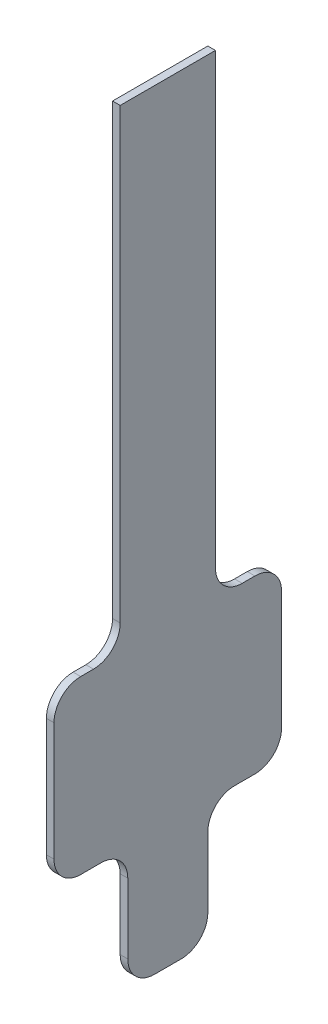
ISO-10303-21;
HEADER;
FILE_DESCRIPTION(('STEP AP214'),'2;1');
FILE_NAME('part.step','',(''),(''),'','','');
FILE_SCHEMA(('AUTOMOTIVE_DESIGN { 1 0 10303 214 1 1 1 1 }'));
ENDSEC;
DATA;
#1=APPLICATION_CONTEXT('core data for automotive mechanical design processes');
#2=APPLICATION_PROTOCOL_DEFINITION('international standard','automotive_design',2000,#1);
#3=PRODUCT_CONTEXT('',#1,'mechanical');
#4=PRODUCT('Part','Part','',(#3));
#5=PRODUCT_RELATED_PRODUCT_CATEGORY('part','',(#4));
#6=PRODUCT_DEFINITION_FORMATION('','',#4);
#7=PRODUCT_DEFINITION_CONTEXT('part definition',#1,'design');
#8=PRODUCT_DEFINITION('design','',#6,#7);
#9=PRODUCT_DEFINITION_SHAPE('','',#8);
#10=(LENGTH_UNIT() NAMED_UNIT(*) SI_UNIT(.MILLI.,.METRE.));
#11=(NAMED_UNIT(*) PLANE_ANGLE_UNIT() SI_UNIT($,.RADIAN.));
#12=(NAMED_UNIT(*) SI_UNIT($,.STERADIAN.) SOLID_ANGLE_UNIT());
#13=UNCERTAINTY_MEASURE_WITH_UNIT(LENGTH_MEASURE(1.E-05),#10,'distance_accuracy_value','');
#14=(GEOMETRIC_REPRESENTATION_CONTEXT(3) GLOBAL_UNCERTAINTY_ASSIGNED_CONTEXT((#13)) GLOBAL_UNIT_ASSIGNED_CONTEXT((#10,
#11,#12)) REPRESENTATION_CONTEXT('',''));
#15=CARTESIAN_POINT('',(0.,0.,0.));
#16=DIRECTION('',(0.,0.,1.));
#17=DIRECTION('',(1.,0.,0.));
#18=AXIS2_PLACEMENT_3D('',#15,#16,#17);
#19=CARTESIAN_POINT('',(0.,100.,20.));
#20=DIRECTION('',(1.,0.,0.));
#21=DIRECTION('',(0.,1.,0.));
#22=AXIS2_PLACEMENT_3D('',#19,#20,#21);
#23=PLANE('',#22);
#24=DIRECTION('',(0.,0.,-1.));
#25=VECTOR('',#24,1.);
#26=CARTESIAN_POINT('',(1.17961196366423E-13,25.,10.5));
#27=LINE('',#26,#25);
#28=CARTESIAN_POINT('',(1.56125112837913E-13,25.,22.8561944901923));
#29=VERTEX_POINT('',#28);
#30=CARTESIAN_POINT('',(1.42247325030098E-13,25.,17.5));
#31=VERTEX_POINT('',#30);
#32=EDGE_CURVE('E356',#29,#31,#27,.T.);
#33=ORIENTED_EDGE('',*,*,#32,.T.);
#34=CARTESIAN_POINT('',(0.,18.,17.5));
#35=DIRECTION('',(1.,0.,0.));
#36=DIRECTION('',(0.,1.,0.));
#37=AXIS2_PLACEMENT_3D('',#34,#35,#36);
#38=CIRCLE('',#37,7.);
#39=CARTESIAN_POINT('',(1.17961196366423E-13,18.,10.5));
#40=VERTEX_POINT('',#39);
#41=EDGE_CURVE('E406',#31,#40,#38,.F.);
#42=ORIENTED_EDGE('',*,*,#41,.T.);
#43=DIRECTION('',(0.,-1.,0.));
#44=VECTOR('',#43,1.);
#45=CARTESIAN_POINT('',(1.17961196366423E-13,25.,10.5));
#46=LINE('',#45,#44);
#47=CARTESIAN_POINT('',(1.1835123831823E-13,-0.356194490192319,10.5));
#48=VERTEX_POINT('',#47);
#49=EDGE_CURVE('E346',#40,#48,#46,.T.);
#50=ORIENTED_EDGE('',*,*,#49,.T.);
#51=CARTESIAN_POINT('',(1.18244486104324E-13,-0.356194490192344,3.50000000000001));
#52=DIRECTION('',(1.,0.,0.));
#53=DIRECTION('',(0.,1.,0.));
#54=AXIS2_PLACEMENT_3D('',#51,#52,#53);
#55=CIRCLE('',#54,7.);
#56=CARTESIAN_POINT('',(1.23703457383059E-13,-7.35619449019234,3.50000000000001));
#57=VERTEX_POINT('',#56);
#58=EDGE_CURVE('E272',#48,#57,#55,.T.);
#59=ORIENTED_EDGE('',*,*,#58,.T.);
#60=DIRECTION('',(0.,0.,-1.));
#61=VECTOR('',#60,1.);
#62=CARTESIAN_POINT('',(1.23703457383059E-13,-7.35619449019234,20.));
#63=LINE('',#62,#61);
#64=CARTESIAN_POINT('',(1.23703457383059E-13,-7.35619449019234,-3.50000000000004));
#65=VERTEX_POINT('',#64);
#66=EDGE_CURVE('E280',#57,#65,#63,.T.);
#67=ORIENTED_EDGE('',*,*,#66,.T.);
#68=CARTESIAN_POINT('',(1.18244486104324E-13,-0.356194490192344,-3.50000000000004));
#69=DIRECTION('',(1.,0.,0.));
#70=DIRECTION('',(0.,1.,0.));
#71=AXIS2_PLACEMENT_3D('',#68,#69,#70);
#72=CIRCLE('',#71,7.);
#73=CARTESIAN_POINT('',(1.19220044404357E-13,-0.356194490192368,-10.5));
#74=VERTEX_POINT('',#73);
#75=EDGE_CURVE('E275',#65,#74,#72,.T.);
#76=ORIENTED_EDGE('',*,*,#75,.T.);
#77=DIRECTION('',(0.,1.,0.));
#78=VECTOR('',#77,1.);
#79=CARTESIAN_POINT('',(0.,25.,-10.5000000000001));
#80=LINE('',#79,#78);
#81=CARTESIAN_POINT('',(0.,18.,-10.5000000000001));
#82=VERTEX_POINT('',#81);
#83=EDGE_CURVE('E256',#74,#82,#80,.T.);
#84=ORIENTED_EDGE('',*,*,#83,.T.);
#85=CARTESIAN_POINT('',(0.,18.,-17.5000000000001));
#86=DIRECTION('',(1.,0.,0.));
#87=DIRECTION('',(0.,1.,0.));
#88=AXIS2_PLACEMENT_3D('',#85,#86,#87);
#89=CIRCLE('',#88,7.);
#90=CARTESIAN_POINT('',(0.,25.,-17.5000000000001));
#91=VERTEX_POINT('',#90);
#92=EDGE_CURVE('E410',#82,#91,#89,.F.);
#93=ORIENTED_EDGE('',*,*,#92,.T.);
#94=DIRECTION('',(0.,0.,-1.));
#95=VECTOR('',#94,1.);
#96=CARTESIAN_POINT('',(0.,25.,-22.5000000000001));
#97=LINE('',#96,#95);
#98=CARTESIAN_POINT('',(0.,25.,-22.8561944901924));
#99=VERTEX_POINT('',#98);
#100=EDGE_CURVE('E362',#91,#99,#97,.T.);
#101=ORIENTED_EDGE('',*,*,#100,.T.);
#102=CARTESIAN_POINT('',(0.,32.,-22.8561944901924));
#103=DIRECTION('',(-1.,0.,0.));
#104=DIRECTION('',(0.,0.,1.));
#105=AXIS2_PLACEMENT_3D('',#102,#103,#104);
#106=CIRCLE('',#105,7.);
#107=CARTESIAN_POINT('',(0.,32.,-29.8561944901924));
#108=VERTEX_POINT('',#107);
#109=EDGE_CURVE('E328',#99,#108,#106,.F.);
#110=ORIENTED_EDGE('',*,*,#109,.T.);
#111=DIRECTION('',(0.,1.,0.));
#112=VECTOR('',#111,1.);
#113=CARTESIAN_POINT('',(0.,100.,-29.8561944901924));
#114=LINE('',#113,#112);
#115=CARTESIAN_POINT('',(0.,63.,-29.8561944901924));
#116=VERTEX_POINT('',#115);
#117=EDGE_CURVE('E333',#108,#116,#114,.T.);
#118=ORIENTED_EDGE('',*,*,#117,.T.);
#119=CARTESIAN_POINT('',(0.,63.,-22.8561944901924));
#120=DIRECTION('',(-1.,0.,0.));
#121=DIRECTION('',(0.,0.,1.));
#122=AXIS2_PLACEMENT_3D('',#119,#120,#121);
#123=CIRCLE('',#122,7.);
#124=CARTESIAN_POINT('',(0.,70.,-22.8561944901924));
#125=VERTEX_POINT('',#124);
#126=EDGE_CURVE('E330',#116,#125,#123,.F.);
#127=ORIENTED_EDGE('',*,*,#126,.T.);
#128=DIRECTION('',(0.,0.,1.));
#129=VECTOR('',#128,1.);
#130=CARTESIAN_POINT('',(0.,70.,-22.5000000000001));
#131=LINE('',#130,#129);
#132=CARTESIAN_POINT('',(0.,70.,-19.5000000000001));
#133=VERTEX_POINT('',#132);
#134=EDGE_CURVE('E375',#125,#133,#131,.T.);
#135=ORIENTED_EDGE('',*,*,#134,.T.);
#136=CARTESIAN_POINT('',(0.,77.,-19.5000000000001));
#137=DIRECTION('',(1.,0.,0.));
#138=DIRECTION('',(0.,1.,0.));
#139=AXIS2_PLACEMENT_3D('',#136,#137,#138);
#140=CIRCLE('',#139,7.);
#141=CARTESIAN_POINT('',(0.,77.,-12.5000000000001));
#142=VERTEX_POINT('',#141);
#143=EDGE_CURVE('E414',#133,#142,#140,.F.);
#144=ORIENTED_EDGE('',*,*,#143,.T.);
#145=DIRECTION('',(0.,1.,0.));
#146=VECTOR('',#145,1.);
#147=CARTESIAN_POINT('',(0.,100.,-12.5000000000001));
#148=LINE('',#147,#146);
#149=CARTESIAN_POINT('',(-5.20417042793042E-13,194.596863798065,-12.5000000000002));
#150=VERTEX_POINT('',#149);
#151=EDGE_CURVE('E378',#142,#150,#148,.T.);
#152=ORIENTED_EDGE('',*,*,#151,.T.);
#153=DIRECTION('',(0.,0.,1.));
#154=VECTOR('',#153,1.);
#155=CARTESIAN_POINT('',(-5.20417042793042E-13,194.596863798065,-12.5000000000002));
#156=LINE('',#155,#154);
#157=CARTESIAN_POINT('',(-6.03683769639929E-13,194.596863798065,12.4999999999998));
#158=VERTEX_POINT('',#157);
#159=EDGE_CURVE('E319',#158,#150,#156,.F.);
#160=ORIENTED_EDGE('',*,*,#159,.F.);
#161=DIRECTION('',(0.,-1.,0.));
#162=VECTOR('',#161,1.);
#163=CARTESIAN_POINT('',(1.21430643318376E-13,100.,12.5));
#164=LINE('',#163,#162);
#165=CARTESIAN_POINT('',(1.22760597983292E-13,77.,12.5));
#166=VERTEX_POINT('',#165);
#167=EDGE_CURVE('E369',#158,#166,#164,.T.);
#168=ORIENTED_EDGE('',*,*,#167,.T.);
#169=CARTESIAN_POINT('',(0.,77.,19.5));
#170=DIRECTION('',(1.,0.,0.));
#171=DIRECTION('',(0.,1.,0.));
#172=AXIS2_PLACEMENT_3D('',#169,#170,#171);
#173=CIRCLE('',#172,7.);
#174=CARTESIAN_POINT('',(1.47451495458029E-13,70.,19.5));
#175=VERTEX_POINT('',#174);
#176=EDGE_CURVE('E13',#166,#175,#173,.F.);
#177=ORIENTED_EDGE('',*,*,#176,.T.);
#178=DIRECTION('',(0.,0.,1.));
#179=VECTOR('',#178,1.);
#180=CARTESIAN_POINT('',(1.57859836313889E-13,70.,22.5));
#181=LINE('',#180,#179);
#182=CARTESIAN_POINT('',(1.49186218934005E-13,70.,22.8561944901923));
#183=VERTEX_POINT('',#182);
#184=EDGE_CURVE('E371',#175,#183,#181,.T.);
#185=ORIENTED_EDGE('',*,*,#184,.T.);
#186=CARTESIAN_POINT('',(1.45716771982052E-13,63.,22.8561944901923));
#187=DIRECTION('',(-1.,0.,0.));
#188=DIRECTION('',(0.,0.,1.));
#189=AXIS2_PLACEMENT_3D('',#186,#187,#188);
#190=CIRCLE('',#189,7.);
#191=CARTESIAN_POINT('',(1.94289029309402E-13,63.,29.8561944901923));
#192=VERTEX_POINT('',#191);
#193=EDGE_CURVE('E306',#183,#192,#190,.F.);
#194=ORIENTED_EDGE('',*,*,#193,.T.);
#195=DIRECTION('',(0.,-1.,0.));
#196=VECTOR('',#195,1.);
#197=CARTESIAN_POINT('',(1.94289029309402E-13,100.,29.8561944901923));
#198=LINE('',#197,#196);
#199=CARTESIAN_POINT('',(1.97758476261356E-13,32.,29.8561944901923));
#200=VERTEX_POINT('',#199);
#201=EDGE_CURVE('E303',#192,#200,#198,.T.);
#202=ORIENTED_EDGE('',*,*,#201,.T.);
#203=CARTESIAN_POINT('',(1.49186218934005E-13,32.,22.8561944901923));
#204=DIRECTION('',(-1.,0.,0.));
#205=DIRECTION('',(0.,0.,1.));
#206=AXIS2_PLACEMENT_3D('',#203,#204,#205);
#207=CIRCLE('',#206,7.);
#208=EDGE_CURVE('E300',#200,#29,#207,.F.);
#209=ORIENTED_EDGE('',*,*,#208,.T.);
#210=EDGE_LOOP('',(#33,#42,#50,#59,#67,#76,#84,#93,#101,#110,#118,#127,#135,#144,#152,#160,#168,
#177,#185,#194,#202,#209));
#211=FACE_BOUND('',#210,.T.);
#212=ADVANCED_FACE('F101',(#211),#23,.T.);
#213=CARTESIAN_POINT('',(-2.,100.,20.));
#214=DIRECTION('',(1.,0.,0.));
#215=DIRECTION('',(0.,1.,0.));
#216=AXIS2_PLACEMENT_3D('',#213,#214,#215);
#217=PLANE('',#216);
#218=DIRECTION('',(0.,-1.,0.));
#219=VECTOR('',#218,1.);
#220=CARTESIAN_POINT('',(-2.,100.,-10.5000000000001));
#221=LINE('',#220,#219);
#222=CARTESIAN_POINT('',(-2.,18.,-10.5));
#223=VERTEX_POINT('',#222);
#224=CARTESIAN_POINT('',(-1.99999999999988,-0.356194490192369,-10.5));
#225=VERTEX_POINT('',#224);
#226=EDGE_CURVE('E367',#223,#225,#221,.T.);
#227=ORIENTED_EDGE('',*,*,#226,.T.);
#228=CARTESIAN_POINT('',(-1.99999999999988,-0.356194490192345,-3.50000000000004));
#229=DIRECTION('',(1.,0.,0.));
#230=DIRECTION('',(0.,1.,0.));
#231=AXIS2_PLACEMENT_3D('',#228,#229,#230);
#232=CIRCLE('',#231,7.);
#233=CARTESIAN_POINT('',(-1.99999999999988,-7.35619449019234,-3.50000000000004));
#234=VERTEX_POINT('',#233);
#235=EDGE_CURVE('E268',#225,#234,#232,.F.);
#236=ORIENTED_EDGE('',*,*,#235,.T.);
#237=DIRECTION('',(0.,0.,-1.));
#238=VECTOR('',#237,1.);
#239=CARTESIAN_POINT('',(-1.99999999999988,-7.35619449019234,20.));
#240=LINE('',#239,#238);
#241=CARTESIAN_POINT('',(-1.99999999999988,-7.35619449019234,3.50000000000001));
#242=VERTEX_POINT('',#241);
#243=EDGE_CURVE('E264',#242,#234,#240,.T.);
#244=ORIENTED_EDGE('',*,*,#243,.F.);
#245=CARTESIAN_POINT('',(-1.99999999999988,-0.356194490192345,3.50000000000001));
#246=DIRECTION('',(1.,0.,0.));
#247=DIRECTION('',(0.,1.,0.));
#248=AXIS2_PLACEMENT_3D('',#245,#246,#247);
#249=CIRCLE('',#248,7.);
#250=CARTESIAN_POINT('',(-1.99999999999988,-0.356194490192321,10.5));
#251=VERTEX_POINT('',#250);
#252=EDGE_CURVE('E261',#242,#251,#249,.F.);
#253=ORIENTED_EDGE('',*,*,#252,.T.);
#254=DIRECTION('',(0.,1.,0.));
#255=VECTOR('',#254,1.);
#256=CARTESIAN_POINT('',(-2.,100.,10.5));
#257=LINE('',#256,#255);
#258=CARTESIAN_POINT('',(-2.,18.,10.5));
#259=VERTEX_POINT('',#258);
#260=EDGE_CURVE('E248',#251,#259,#257,.T.);
#261=ORIENTED_EDGE('',*,*,#260,.T.);
#262=CARTESIAN_POINT('',(-2.,18.,17.5));
#263=DIRECTION('',(1.,0.,0.));
#264=DIRECTION('',(0.,1.,0.));
#265=AXIS2_PLACEMENT_3D('',#262,#263,#264);
#266=CIRCLE('',#265,7.);
#267=CARTESIAN_POINT('',(-2.,25.,17.5));
#268=VERTEX_POINT('',#267);
#269=EDGE_CURVE('E404',#259,#268,#266,.T.);
#270=ORIENTED_EDGE('',*,*,#269,.T.);
#271=DIRECTION('',(0.,0.,1.));
#272=VECTOR('',#271,1.);
#273=CARTESIAN_POINT('',(-2.,25.,20.));
#274=LINE('',#273,#272);
#275=CARTESIAN_POINT('',(-1.99999999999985,25.,22.8561944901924));
#276=VERTEX_POINT('',#275);
#277=EDGE_CURVE('E257',#268,#276,#274,.T.);
#278=ORIENTED_EDGE('',*,*,#277,.T.);
#279=CARTESIAN_POINT('',(-1.99999999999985,32.,22.8561944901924));
#280=DIRECTION('',(-1.,0.,0.));
#281=DIRECTION('',(0.,0.,1.));
#282=AXIS2_PLACEMENT_3D('',#279,#280,#281);
#283=CIRCLE('',#282,7.);
#284=CARTESIAN_POINT('',(-1.9999999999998,32.,29.8561944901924));
#285=VERTEX_POINT('',#284);
#286=EDGE_CURVE('E292',#276,#285,#283,.T.);
#287=ORIENTED_EDGE('',*,*,#286,.T.);
#288=DIRECTION('',(0.,1.,0.));
#289=VECTOR('',#288,1.);
#290=CARTESIAN_POINT('',(-1.9999999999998,2.5,29.8561944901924));
#291=LINE('',#290,#289);
#292=CARTESIAN_POINT('',(-1.9999999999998,63.,29.8561944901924));
#293=VERTEX_POINT('',#292);
#294=EDGE_CURVE('E310',#293,#285,#291,.F.);
#295=ORIENTED_EDGE('',*,*,#294,.F.);
#296=CARTESIAN_POINT('',(-1.99999999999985,63.,22.8561944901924));
#297=DIRECTION('',(-1.,0.,0.));
#298=DIRECTION('',(0.,0.,1.));
#299=AXIS2_PLACEMENT_3D('',#296,#297,#298);
#300=CIRCLE('',#299,7.);
#301=CARTESIAN_POINT('',(-1.99999999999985,70.,22.8561944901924));
#302=VERTEX_POINT('',#301);
#303=EDGE_CURVE('E294',#293,#302,#300,.T.);
#304=ORIENTED_EDGE('',*,*,#303,.T.);
#305=DIRECTION('',(0.,0.,-1.));
#306=VECTOR('',#305,1.);
#307=CARTESIAN_POINT('',(-2.,70.,20.));
#308=LINE('',#307,#306);
#309=CARTESIAN_POINT('',(-2.,70.,19.5));
#310=VERTEX_POINT('',#309);
#311=EDGE_CURVE('E373',#302,#310,#308,.T.);
#312=ORIENTED_EDGE('',*,*,#311,.T.);
#313=CARTESIAN_POINT('',(-2.,77.,19.5));
#314=DIRECTION('',(1.,0.,0.));
#315=DIRECTION('',(0.,1.,0.));
#316=AXIS2_PLACEMENT_3D('',#313,#314,#315);
#317=CIRCLE('',#316,7.);
#318=CARTESIAN_POINT('',(-2.,77.,12.5));
#319=VERTEX_POINT('',#318);
#320=EDGE_CURVE('E108',#310,#319,#317,.T.);
#321=ORIENTED_EDGE('',*,*,#320,.T.);
#322=DIRECTION('',(0.,1.,0.));
#323=VECTOR('',#322,1.);
#324=CARTESIAN_POINT('',(-2.,100.,12.5));
#325=LINE('',#324,#323);
#326=CARTESIAN_POINT('',(-2.00000000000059,194.596863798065,12.4999999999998));
#327=VERTEX_POINT('',#326);
#328=EDGE_CURVE('E385',#319,#327,#325,.T.);
#329=ORIENTED_EDGE('',*,*,#328,.T.);
#330=DIRECTION('',(0.,0.,-1.));
#331=VECTOR('',#330,1.);
#332=CARTESIAN_POINT('',(-2.00000000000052,194.596863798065,-12.5000000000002));
#333=LINE('',#332,#331);
#334=CARTESIAN_POINT('',(-2.00000000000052,194.596863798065,-12.5000000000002));
#335=VERTEX_POINT('',#334);
#336=EDGE_CURVE('E343',#327,#335,#333,.T.);
#337=ORIENTED_EDGE('',*,*,#336,.T.);
#338=DIRECTION('',(0.,-1.,0.));
#339=VECTOR('',#338,1.);
#340=CARTESIAN_POINT('',(-2.,100.,-12.5));
#341=LINE('',#340,#339);
#342=CARTESIAN_POINT('',(-2.,77.,-12.5));
#343=VERTEX_POINT('',#342);
#344=EDGE_CURVE('E382',#335,#343,#341,.T.);
#345=ORIENTED_EDGE('',*,*,#344,.T.);
#346=CARTESIAN_POINT('',(-2.,77.,-19.5000000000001));
#347=DIRECTION('',(1.,0.,0.));
#348=DIRECTION('',(0.,1.,0.));
#349=AXIS2_PLACEMENT_3D('',#346,#347,#348);
#350=CIRCLE('',#349,7.);
#351=CARTESIAN_POINT('',(-2.,70.,-19.5));
#352=VERTEX_POINT('',#351);
#353=EDGE_CURVE('E412',#343,#352,#350,.T.);
#354=ORIENTED_EDGE('',*,*,#353,.T.);
#355=DIRECTION('',(0.,0.,-1.));
#356=VECTOR('',#355,1.);
#357=CARTESIAN_POINT('',(-2.,70.,20.));
#358=LINE('',#357,#356);
#359=CARTESIAN_POINT('',(-2.00000000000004,70.,-22.8561944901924));
#360=VERTEX_POINT('',#359);
#361=EDGE_CURVE('E380',#352,#360,#358,.T.);
#362=ORIENTED_EDGE('',*,*,#361,.T.);
#363=CARTESIAN_POINT('',(-2.00000000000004,63.,-22.8561944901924));
#364=DIRECTION('',(-1.,0.,0.));
#365=DIRECTION('',(0.,0.,1.));
#366=AXIS2_PLACEMENT_3D('',#363,#364,#365);
#367=CIRCLE('',#366,7.);
#368=CARTESIAN_POINT('',(-1.99999999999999,63.,-29.8561944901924));
#369=VERTEX_POINT('',#368);
#370=EDGE_CURVE('E323',#360,#369,#367,.T.);
#371=ORIENTED_EDGE('',*,*,#370,.T.);
#372=DIRECTION('',(0.,-1.,0.));
#373=VECTOR('',#372,1.);
#374=CARTESIAN_POINT('',(-1.99999999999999,100.,-29.8561944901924));
#375=LINE('',#374,#373);
#376=CARTESIAN_POINT('',(-1.99999999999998,32.,-29.8561944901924));
#377=VERTEX_POINT('',#376);
#378=EDGE_CURVE('E291',#377,#369,#375,.F.);
#379=ORIENTED_EDGE('',*,*,#378,.F.);
#380=CARTESIAN_POINT('',(-2.00000000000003,32.,-22.8561944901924));
#381=DIRECTION('',(-1.,0.,0.));
#382=DIRECTION('',(0.,0.,1.));
#383=AXIS2_PLACEMENT_3D('',#380,#381,#382);
#384=CIRCLE('',#383,7.);
#385=CARTESIAN_POINT('',(-2.00000000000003,25.,-22.8561944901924));
#386=VERTEX_POINT('',#385);
#387=EDGE_CURVE('E320',#377,#386,#384,.T.);
#388=ORIENTED_EDGE('',*,*,#387,.T.);
#389=DIRECTION('',(0.,0.,1.));
#390=VECTOR('',#389,1.);
#391=CARTESIAN_POINT('',(-2.,25.,20.));
#392=LINE('',#391,#390);
#393=CARTESIAN_POINT('',(-2.,25.,-17.5));
#394=VERTEX_POINT('',#393);
#395=EDGE_CURVE('E364',#386,#394,#392,.T.);
#396=ORIENTED_EDGE('',*,*,#395,.T.);
#397=CARTESIAN_POINT('',(-2.,18.,-17.5));
#398=DIRECTION('',(1.,0.,0.));
#399=DIRECTION('',(0.,1.,0.));
#400=AXIS2_PLACEMENT_3D('',#397,#398,#399);
#401=CIRCLE('',#400,7.);
#402=EDGE_CURVE('E408',#394,#223,#401,.T.);
#403=ORIENTED_EDGE('',*,*,#402,.T.);
#404=EDGE_LOOP('',(#227,#236,#244,#253,#261,#270,#278,#287,#295,#304,#312,#321,#329,#337,#345,
#354,#362,#371,#379,#388,#396,#403));
#405=FACE_BOUND('',#404,.T.);
#406=ADVANCED_FACE('F262',(#405),#217,.F.);
#407=CARTESIAN_POINT('',(0.,100.,-12.5000000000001));
#408=DIRECTION('',(0.,0.,1.));
#409=DIRECTION('',(1.,0.,0.));
#410=AXIS2_PLACEMENT_3D('',#407,#408,#409);
#411=PLANE('',#410);
#412=ORIENTED_EDGE('',*,*,#151,.F.);
#413=DIRECTION('',(-1.,0.,0.));
#414=VECTOR('',#413,1.);
#415=CARTESIAN_POINT('',(-2.,77.,-12.5000000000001));
#416=LINE('',#415,#414);
#417=EDGE_CURVE('E395',#142,#343,#416,.T.);
#418=ORIENTED_EDGE('',*,*,#417,.T.);
#419=ORIENTED_EDGE('',*,*,#344,.F.);
#420=DIRECTION('',(1.,0.,0.));
#421=VECTOR('',#420,1.);
#422=CARTESIAN_POINT('',(-2.00000000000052,194.596863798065,-12.5000000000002));
#423=LINE('',#422,#421);
#424=EDGE_CURVE('E347',#335,#150,#423,.T.);
#425=ORIENTED_EDGE('',*,*,#424,.T.);
#426=EDGE_LOOP('',(#412,#418,#419,#425));
#427=FACE_BOUND('',#426,.T.);
#428=ADVANCED_FACE('F423',(#427),#411,.F.);
#429=CARTESIAN_POINT('',(0.,70.,-22.5000000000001));
#430=DIRECTION('',(0.,-1.,0.));
#431=DIRECTION('',(1.,0.,0.));
#432=AXIS2_PLACEMENT_3D('',#429,#430,#431);
#433=PLANE('',#432);
#434=ORIENTED_EDGE('',*,*,#134,.F.);
#435=DIRECTION('',(-1.,0.,0.));
#436=VECTOR('',#435,1.);
#437=CARTESIAN_POINT('',(0.,70.,-22.8561944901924));
#438=LINE('',#437,#436);
#439=EDGE_CURVE('E316',#125,#360,#438,.T.);
#440=ORIENTED_EDGE('',*,*,#439,.T.);
#441=ORIENTED_EDGE('',*,*,#361,.F.);
#442=DIRECTION('',(-1.,0.,0.));
#443=VECTOR('',#442,1.);
#444=CARTESIAN_POINT('',(0.,70.,-19.5000000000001));
#445=LINE('',#444,#443);
#446=EDGE_CURVE('E398',#352,#133,#445,.F.);
#447=ORIENTED_EDGE('',*,*,#446,.T.);
#448=EDGE_LOOP('',(#434,#440,#441,#447));
#449=FACE_BOUND('',#448,.T.);
#450=ADVANCED_FACE('F429',(#449),#433,.F.);
#451=CARTESIAN_POINT('',(1.21430643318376E-13,100.,12.5));
#452=DIRECTION('',(0.,0.,-1.));
#453=DIRECTION('',(-1.,0.,0.));
#454=AXIS2_PLACEMENT_3D('',#451,#452,#453);
#455=PLANE('',#454);
#456=ORIENTED_EDGE('',*,*,#328,.F.);
#457=DIRECTION('',(-1.,0.,0.));
#458=VECTOR('',#457,1.);
#459=CARTESIAN_POINT('',(1.22916278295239E-13,77.,12.5));
#460=LINE('',#459,#458);
#461=EDGE_CURVE('E121',#319,#166,#460,.F.);
#462=ORIENTED_EDGE('',*,*,#461,.T.);
#463=ORIENTED_EDGE('',*,*,#167,.F.);
#464=DIRECTION('',(1.,0.,0.));
#465=VECTOR('',#464,1.);
#466=CARTESIAN_POINT('',(-2.0000000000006,194.596863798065,12.4999999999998));
#467=LINE('',#466,#465);
#468=EDGE_CURVE('E350',#327,#158,#467,.T.);
#469=ORIENTED_EDGE('',*,*,#468,.F.);
#470=EDGE_LOOP('',(#456,#462,#463,#469));
#471=FACE_BOUND('',#470,.T.);
#472=ADVANCED_FACE('F502',(#471),#455,.F.);
#473=CARTESIAN_POINT('',(1.57859836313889E-13,70.,22.5));
#474=DIRECTION('',(0.,-1.,0.));
#475=DIRECTION('',(1.,0.,0.));
#476=AXIS2_PLACEMENT_3D('',#473,#474,#475);
#477=PLANE('',#476);
#478=ORIENTED_EDGE('',*,*,#311,.F.);
#479=DIRECTION('',(-1.,0.,0.));
#480=VECTOR('',#479,1.);
#481=CARTESIAN_POINT('',(1.49186218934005E-13,70.,22.8561944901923));
#482=LINE('',#481,#480);
#483=EDGE_CURVE('E297',#302,#183,#482,.F.);
#484=ORIENTED_EDGE('',*,*,#483,.T.);
#485=ORIENTED_EDGE('',*,*,#184,.F.);
#486=DIRECTION('',(-1.,0.,0.));
#487=VECTOR('',#486,1.);
#488=CARTESIAN_POINT('',(-1.99999999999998,70.,19.5));
#489=LINE('',#488,#487);
#490=EDGE_CURVE('E400',#175,#310,#489,.T.);
#491=ORIENTED_EDGE('',*,*,#490,.T.);
#492=EDGE_LOOP('',(#478,#484,#485,#491));
#493=FACE_BOUND('',#492,.T.);
#494=ADVANCED_FACE('F503',(#493),#477,.F.);
#495=CARTESIAN_POINT('',(0.,25.,-10.5000000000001));
#496=DIRECTION('',(0.,0.,1.));
#497=DIRECTION('',(1.,0.,0.));
#498=AXIS2_PLACEMENT_3D('',#495,#496,#497);
#499=PLANE('',#498);
#500=ORIENTED_EDGE('',*,*,#83,.F.);
#501=DIRECTION('',(-1.,0.,0.));
#502=VECTOR('',#501,1.);
#503=CARTESIAN_POINT('',(-1.99999999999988,-0.356194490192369,-10.5));
#504=LINE('',#503,#502);
#505=EDGE_CURVE('E267',#74,#225,#504,.T.);
#506=ORIENTED_EDGE('',*,*,#505,.T.);
#507=ORIENTED_EDGE('',*,*,#226,.F.);
#508=DIRECTION('',(-1.,0.,0.));
#509=VECTOR('',#508,1.);
#510=CARTESIAN_POINT('',(0.,18.,-10.5000000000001));
#511=LINE('',#510,#509);
#512=EDGE_CURVE('E393',#223,#82,#511,.F.);
#513=ORIENTED_EDGE('',*,*,#512,.T.);
#514=EDGE_LOOP('',(#500,#506,#507,#513));
#515=FACE_BOUND('',#514,.T.);
#516=ADVANCED_FACE('F454',(#515),#499,.F.);
#517=CARTESIAN_POINT('',(0.,25.,-22.5000000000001));
#518=DIRECTION('',(0.,1.,0.));
#519=DIRECTION('',(-1.,0.,0.));
#520=AXIS2_PLACEMENT_3D('',#517,#518,#519);
#521=PLANE('',#520);
#522=ORIENTED_EDGE('',*,*,#395,.F.);
#523=DIRECTION('',(-1.,0.,0.));
#524=VECTOR('',#523,1.);
#525=CARTESIAN_POINT('',(0.,25.,-22.8561944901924));
#526=LINE('',#525,#524);
#527=EDGE_CURVE('E325',#386,#99,#526,.F.);
#528=ORIENTED_EDGE('',*,*,#527,.T.);
#529=ORIENTED_EDGE('',*,*,#100,.F.);
#530=DIRECTION('',(-1.,0.,0.));
#531=VECTOR('',#530,1.);
#532=CARTESIAN_POINT('',(-2.00000000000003,25.,-17.5));
#533=LINE('',#532,#531);
#534=EDGE_CURVE('E390',#91,#394,#533,.T.);
#535=ORIENTED_EDGE('',*,*,#534,.T.);
#536=EDGE_LOOP('',(#522,#528,#529,#535));
#537=FACE_BOUND('',#536,.T.);
#538=ADVANCED_FACE('F446',(#537),#521,.F.);
#539=CARTESIAN_POINT('',(1.17961196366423E-13,25.,10.5));
#540=DIRECTION('',(0.,0.,-1.));
#541=DIRECTION('',(-1.,0.,0.));
#542=AXIS2_PLACEMENT_3D('',#539,#540,#541);
#543=PLANE('',#542);
#544=ORIENTED_EDGE('',*,*,#260,.F.);
#545=DIRECTION('',(1.,0.,0.));
#546=VECTOR('',#545,1.);
#547=CARTESIAN_POINT('',(1.19771042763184E-13,-0.356194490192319,10.5));
#548=LINE('',#547,#546);
#549=EDGE_CURVE('E253',#251,#48,#548,.T.);
#550=ORIENTED_EDGE('',*,*,#549,.T.);
#551=ORIENTED_EDGE('',*,*,#49,.F.);
#552=DIRECTION('',(-1.,0.,0.));
#553=VECTOR('',#552,1.);
#554=CARTESIAN_POINT('',(-2.,18.,10.5));
#555=LINE('',#554,#553);
#556=EDGE_CURVE('E255',#40,#259,#555,.T.);
#557=ORIENTED_EDGE('',*,*,#556,.T.);
#558=EDGE_LOOP('',(#544,#550,#551,#557));
#559=FACE_BOUND('',#558,.T.);
#560=ADVANCED_FACE('F250',(#559),#543,.F.);
#561=CARTESIAN_POINT('',(1.17961196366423E-13,25.,10.5));
#562=DIRECTION('',(0.,1.,0.));
#563=DIRECTION('',(-1.,0.,0.));
#564=AXIS2_PLACEMENT_3D('',#561,#562,#563);
#565=PLANE('',#564);
#566=ORIENTED_EDGE('',*,*,#32,.F.);
#567=DIRECTION('',(-1.,0.,0.));
#568=VECTOR('',#567,1.);
#569=CARTESIAN_POINT('',(-11.9999999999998,25.,22.8561944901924));
#570=LINE('',#569,#568);
#571=EDGE_CURVE('E288',#29,#276,#570,.T.);
#572=ORIENTED_EDGE('',*,*,#571,.T.);
#573=ORIENTED_EDGE('',*,*,#277,.F.);
#574=DIRECTION('',(-1.,0.,0.));
#575=VECTOR('',#574,1.);
#576=CARTESIAN_POINT('',(1.42401579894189E-13,25.,17.5));
#577=LINE('',#576,#575);
#578=EDGE_CURVE('E388',#268,#31,#577,.F.);
#579=ORIENTED_EDGE('',*,*,#578,.T.);
#580=EDGE_LOOP('',(#566,#572,#573,#579));
#581=FACE_BOUND('',#580,.T.);
#582=ADVANCED_FACE('F487',(#581),#565,.F.);
#583=CARTESIAN_POINT('',(1.42650668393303E-13,18.,17.5));
#584=DIRECTION('',(1.,0.,0.));
#585=DIRECTION('',(0.,0.,-1.));
#586=AXIS2_PLACEMENT_3D('',#583,#584,#585);
#587=CYLINDRICAL_SURFACE('',#586,7.);
#588=ORIENTED_EDGE('',*,*,#41,.F.);
#589=ORIENTED_EDGE('',*,*,#578,.F.);
#590=ORIENTED_EDGE('',*,*,#269,.F.);
#591=ORIENTED_EDGE('',*,*,#556,.F.);
#592=EDGE_LOOP('',(#588,#589,#590,#591));
#593=FACE_BOUND('',#592,.T.);
#594=ADVANCED_FACE('F484',(#593),#587,.F.);
#595=CARTESIAN_POINT('',(0.,18.,-17.5000000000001));
#596=DIRECTION('',(1.,0.,0.));
#597=DIRECTION('',(0.,0.,-1.));
#598=AXIS2_PLACEMENT_3D('',#595,#596,#597);
#599=CYLINDRICAL_SURFACE('',#598,7.);
#600=ORIENTED_EDGE('',*,*,#92,.F.);
#601=ORIENTED_EDGE('',*,*,#512,.F.);
#602=ORIENTED_EDGE('',*,*,#402,.F.);
#603=ORIENTED_EDGE('',*,*,#534,.F.);
#604=EDGE_LOOP('',(#600,#601,#602,#603));
#605=FACE_BOUND('',#604,.T.);
#606=ADVANCED_FACE('F451',(#605),#599,.F.);
#607=CARTESIAN_POINT('',(0.,77.,-19.5000000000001));
#608=DIRECTION('',(1.,0.,0.));
#609=DIRECTION('',(0.,0.,-1.));
#610=AXIS2_PLACEMENT_3D('',#607,#608,#609);
#611=CYLINDRICAL_SURFACE('',#610,7.);
#612=ORIENTED_EDGE('',*,*,#143,.F.);
#613=ORIENTED_EDGE('',*,*,#446,.F.);
#614=ORIENTED_EDGE('',*,*,#353,.F.);
#615=ORIENTED_EDGE('',*,*,#417,.F.);
#616=EDGE_LOOP('',(#612,#613,#614,#615));
#617=FACE_BOUND('',#616,.T.);
#618=ADVANCED_FACE('F425',(#617),#611,.F.);
#619=CARTESIAN_POINT('',(1.47136297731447E-13,77.,19.5));
#620=DIRECTION('',(1.,0.,0.));
#621=DIRECTION('',(0.,0.,-1.));
#622=AXIS2_PLACEMENT_3D('',#619,#620,#621);
#623=CYLINDRICAL_SURFACE('',#622,7.);
#624=ORIENTED_EDGE('',*,*,#176,.F.);
#625=ORIENTED_EDGE('',*,*,#461,.F.);
#626=ORIENTED_EDGE('',*,*,#320,.F.);
#627=ORIENTED_EDGE('',*,*,#490,.F.);
#628=EDGE_LOOP('',(#624,#625,#626,#627));
#629=FACE_BOUND('',#628,.T.);
#630=ADVANCED_FACE('F493',(#629),#623,.F.);
#631=CARTESIAN_POINT('',(-2.00000000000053,194.596863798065,-12.5000000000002));
#632=DIRECTION('',(0.,-1.,0.));
#633=DIRECTION('',(1.,0.,0.));
#634=AXIS2_PLACEMENT_3D('',#631,#632,#633);
#635=PLANE('',#634);
#636=ORIENTED_EDGE('',*,*,#159,.T.);
#637=ORIENTED_EDGE('',*,*,#424,.F.);
#638=ORIENTED_EDGE('',*,*,#336,.F.);
#639=ORIENTED_EDGE('',*,*,#468,.T.);
#640=EDGE_LOOP('',(#636,#637,#638,#639));
#641=FACE_BOUND('',#640,.T.);
#642=ADVANCED_FACE('F496',(#641),#635,.F.);
#643=CARTESIAN_POINT('',(0.,32.,-22.8561944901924));
#644=DIRECTION('',(-1.,0.,0.));
#645=DIRECTION('',(0.,0.,1.));
#646=AXIS2_PLACEMENT_3D('',#643,#644,#645);
#647=CYLINDRICAL_SURFACE('',#646,7.);
#648=ORIENTED_EDGE('',*,*,#109,.F.);
#649=ORIENTED_EDGE('',*,*,#527,.F.);
#650=ORIENTED_EDGE('',*,*,#387,.F.);
#651=DIRECTION('',(-1.,0.,0.));
#652=VECTOR('',#651,1.);
#653=CARTESIAN_POINT('',(0.,32.,-29.8561944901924));
#654=LINE('',#653,#652);
#655=EDGE_CURVE('E336',#108,#377,#654,.T.);
#656=ORIENTED_EDGE('',*,*,#655,.F.);
#657=EDGE_LOOP('',(#648,#649,#650,#656));
#658=FACE_BOUND('',#657,.T.);
#659=ADVANCED_FACE('F442',(#658),#647,.T.);
#660=CARTESIAN_POINT('',(0.,63.,-22.8561944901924));
#661=DIRECTION('',(-1.,0.,0.));
#662=DIRECTION('',(0.,0.,1.));
#663=AXIS2_PLACEMENT_3D('',#660,#661,#662);
#664=CYLINDRICAL_SURFACE('',#663,7.);
#665=ORIENTED_EDGE('',*,*,#126,.F.);
#666=DIRECTION('',(-1.,0.,0.));
#667=VECTOR('',#666,1.);
#668=CARTESIAN_POINT('',(0.,63.,-29.8561944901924));
#669=LINE('',#668,#667);
#670=EDGE_CURVE('E339',#369,#116,#669,.F.);
#671=ORIENTED_EDGE('',*,*,#670,.F.);
#672=ORIENTED_EDGE('',*,*,#370,.F.);
#673=ORIENTED_EDGE('',*,*,#439,.F.);
#674=EDGE_LOOP('',(#665,#671,#672,#673));
#675=FACE_BOUND('',#674,.T.);
#676=ADVANCED_FACE('F433',(#675),#664,.T.);
#677=CARTESIAN_POINT('',(0.,100.,-29.8561944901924));
#678=DIRECTION('',(0.,0.,1.));
#679=DIRECTION('',(1.,0.,0.));
#680=AXIS2_PLACEMENT_3D('',#677,#678,#679);
#681=PLANE('',#680);
#682=ORIENTED_EDGE('',*,*,#378,.T.);
#683=ORIENTED_EDGE('',*,*,#670,.T.);
#684=ORIENTED_EDGE('',*,*,#117,.F.);
#685=ORIENTED_EDGE('',*,*,#655,.T.);
#686=EDGE_LOOP('',(#682,#683,#684,#685));
#687=FACE_BOUND('',#686,.T.);
#688=ADVANCED_FACE('F437',(#687),#681,.F.);
#689=CARTESIAN_POINT('',(-11.9999999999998,32.,22.8561944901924));
#690=DIRECTION('',(-1.,0.,0.));
#691=DIRECTION('',(0.,0.,1.));
#692=AXIS2_PLACEMENT_3D('',#689,#690,#691);
#693=CYLINDRICAL_SURFACE('',#692,7.);
#694=ORIENTED_EDGE('',*,*,#208,.F.);
#695=DIRECTION('',(-1.,0.,0.));
#696=VECTOR('',#695,1.);
#697=CARTESIAN_POINT('',(1.97758476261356E-13,32.,29.8561944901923));
#698=LINE('',#697,#696);
#699=EDGE_CURVE('E308',#285,#200,#698,.F.);
#700=ORIENTED_EDGE('',*,*,#699,.F.);
#701=ORIENTED_EDGE('',*,*,#286,.F.);
#702=ORIENTED_EDGE('',*,*,#571,.F.);
#703=EDGE_LOOP('',(#694,#700,#701,#702));
#704=FACE_BOUND('',#703,.T.);
#705=ADVANCED_FACE('F570',(#704),#693,.T.);
#706=CARTESIAN_POINT('',(1.97758476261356E-13,2.5,29.8561944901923));
#707=DIRECTION('',(0.,0.,-1.));
#708=DIRECTION('',(-1.,0.,0.));
#709=AXIS2_PLACEMENT_3D('',#706,#707,#708);
#710=PLANE('',#709);
#711=ORIENTED_EDGE('',*,*,#201,.F.);
#712=DIRECTION('',(-1.,0.,0.));
#713=VECTOR('',#712,1.);
#714=CARTESIAN_POINT('',(1.94289029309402E-13,63.,29.8561944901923));
#715=LINE('',#714,#713);
#716=EDGE_CURVE('E313',#192,#293,#715,.T.);
#717=ORIENTED_EDGE('',*,*,#716,.T.);
#718=ORIENTED_EDGE('',*,*,#294,.T.);
#719=ORIENTED_EDGE('',*,*,#699,.T.);
#720=EDGE_LOOP('',(#711,#717,#718,#719));
#721=FACE_BOUND('',#720,.T.);
#722=ADVANCED_FACE('F577',(#721),#710,.F.);
#723=CARTESIAN_POINT('',(1.45716771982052E-13,63.,22.8561944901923));
#724=DIRECTION('',(-1.,0.,0.));
#725=DIRECTION('',(0.,0.,1.));
#726=AXIS2_PLACEMENT_3D('',#723,#724,#725);
#727=CYLINDRICAL_SURFACE('',#726,7.);
#728=ORIENTED_EDGE('',*,*,#193,.F.);
#729=ORIENTED_EDGE('',*,*,#483,.F.);
#730=ORIENTED_EDGE('',*,*,#303,.F.);
#731=ORIENTED_EDGE('',*,*,#716,.F.);
#732=EDGE_LOOP('',(#728,#729,#730,#731));
#733=FACE_BOUND('',#732,.T.);
#734=ADVANCED_FACE('F584',(#733),#727,.T.);
#735=CARTESIAN_POINT('',(-24.9999999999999,-0.356194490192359,3.50000000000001));
#736=DIRECTION('',(-1.,0.,0.));
#737=DIRECTION('',(0.,0.,1.));
#738=AXIS2_PLACEMENT_3D('',#735,#736,#737);
#739=CYLINDRICAL_SURFACE('',#738,7.);
#740=ORIENTED_EDGE('',*,*,#252,.F.);
#741=DIRECTION('',(1.,0.,0.));
#742=VECTOR('',#741,1.);
#743=CARTESIAN_POINT('',(-1.99999999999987,-7.35619449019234,3.50000000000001));
#744=LINE('',#743,#742);
#745=EDGE_CURVE('E283',#57,#242,#744,.F.);
#746=ORIENTED_EDGE('',*,*,#745,.F.);
#747=ORIENTED_EDGE('',*,*,#58,.F.);
#748=ORIENTED_EDGE('',*,*,#549,.F.);
#749=EDGE_LOOP('',(#740,#746,#747,#748));
#750=FACE_BOUND('',#749,.T.);
#751=ADVANCED_FACE('F271',(#750),#739,.T.);
#752=CARTESIAN_POINT('',(-24.9999999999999,-0.356194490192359,-3.50000000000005));
#753=DIRECTION('',(1.,0.,0.));
#754=DIRECTION('',(0.,0.,-1.));
#755=AXIS2_PLACEMENT_3D('',#752,#753,#754);
#756=CYLINDRICAL_SURFACE('',#755,7.);
#757=ORIENTED_EDGE('',*,*,#75,.F.);
#758=DIRECTION('',(-1.,0.,0.));
#759=VECTOR('',#758,1.);
#760=CARTESIAN_POINT('',(1.22478810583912E-13,-7.35619449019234,-3.50000000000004));
#761=LINE('',#760,#759);
#762=EDGE_CURVE('E285',#234,#65,#761,.F.);
#763=ORIENTED_EDGE('',*,*,#762,.F.);
#764=ORIENTED_EDGE('',*,*,#235,.F.);
#765=ORIENTED_EDGE('',*,*,#505,.F.);
#766=EDGE_LOOP('',(#757,#763,#764,#765));
#767=FACE_BOUND('',#766,.T.);
#768=ADVANCED_FACE('F462',(#767),#756,.T.);
#769=CARTESIAN_POINT('',(1.23703457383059E-13,-7.35619449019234,20.));
#770=DIRECTION('',(0.,-1.,0.));
#771=DIRECTION('',(0.,0.,1.));
#772=AXIS2_PLACEMENT_3D('',#769,#770,#771);
#773=PLANE('',#772);
#774=ORIENTED_EDGE('',*,*,#243,.T.);
#775=ORIENTED_EDGE('',*,*,#762,.T.);
#776=ORIENTED_EDGE('',*,*,#66,.F.);
#777=ORIENTED_EDGE('',*,*,#745,.T.);
#778=EDGE_LOOP('',(#774,#775,#776,#777));
#779=FACE_BOUND('',#778,.T.);
#780=ADVANCED_FACE('F465',(#779),#773,.T.);
#781=CLOSED_SHELL('',(#212,#406,#428,#450,#472,#494,#516,#538,#560,#582,#594,#606,#618,#630,
#642,#659,#676,#688,#705,#722,#734,#751,#768,#780));
#782=MANIFOLD_SOLID_BREP('B2',#781);
#783=ADVANCED_BREP_SHAPE_REPRESENTATION('',(#18,#782),#14);
#784=SHAPE_DEFINITION_REPRESENTATION(#9,#783);
ENDSEC;
END-ISO-10303-21;
